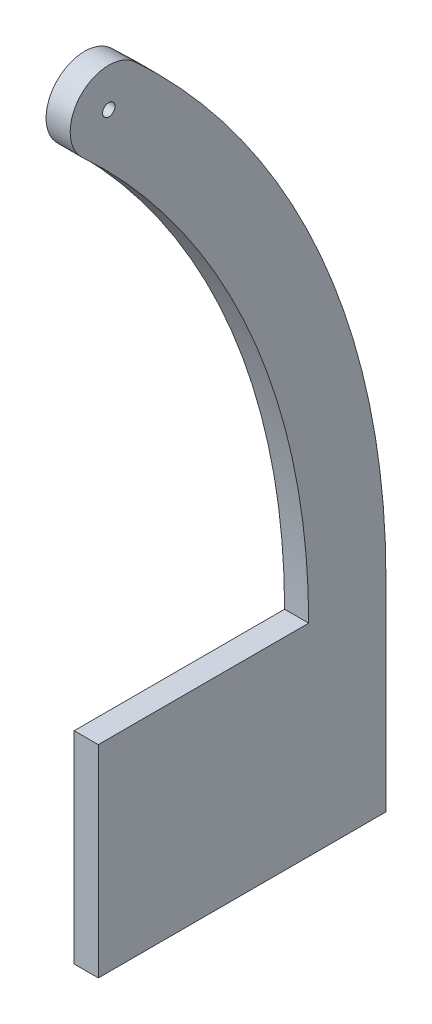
from build123d import *

# Parameters (mm, degrees)
SKETCH1_R           = 1.6
BOSS_EXTRUDE1_DEPTH = 6.2


with BuildPart() as part:
    # Sketch1 → Boss-Extrude1 (new body)
    with BuildSketch(Plane(origin=(0, 0, 0), x_dir=(0, 0, -1), z_dir=(1, 0, 0))):
        with BuildLine():
            Line((0, 52), (0, 0))
            Line((0, 0), (-74, 0))
            Line((-74, 0), (-74, 52))
            Line((-74, 52), (-19.868182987, 52))
            ThreePointArc((-19.868182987, 52), (-35.047371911, 124.491063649), (-78.034585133, 184.802435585))
            ThreePointArc((-78.034585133, 184.802435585), (-78.599880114, 198.839984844), (-64.562330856, 199.405279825))
            ThreePointArc((-64.562330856, 199.405279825), (-16.848279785, 132.462120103), (0, 52))
        make_face()
        with Locations(Location((-71.298457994, 192.103857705, 0), (0, 0, 180))):
            Circle(SKETCH1_R, mode=Mode.SUBTRACT)
    extrude(amount=BOSS_EXTRUDE1_DEPTH)


solid = part.part
